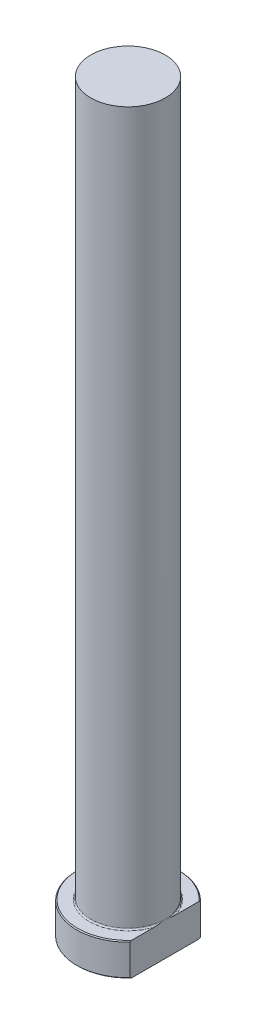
ISO-10303-21;
HEADER;
FILE_DESCRIPTION(('STEP AP214'),'2;1');
FILE_NAME('part.step','',(''),(''),'','','');
FILE_SCHEMA(('AUTOMOTIVE_DESIGN { 1 0 10303 214 1 1 1 1 }'));
ENDSEC;
DATA;
#1=APPLICATION_CONTEXT('core data for automotive mechanical design processes');
#2=APPLICATION_PROTOCOL_DEFINITION('international standard','automotive_design',2000,#1);
#3=PRODUCT_CONTEXT('',#1,'mechanical');
#4=PRODUCT('Part','Part','',(#3));
#5=PRODUCT_RELATED_PRODUCT_CATEGORY('part','',(#4));
#6=PRODUCT_DEFINITION_FORMATION('','',#4);
#7=PRODUCT_DEFINITION_CONTEXT('part definition',#1,'design');
#8=PRODUCT_DEFINITION('design','',#6,#7);
#9=PRODUCT_DEFINITION_SHAPE('','',#8);
#10=(LENGTH_UNIT() NAMED_UNIT(*) SI_UNIT(.MILLI.,.METRE.));
#11=(NAMED_UNIT(*) PLANE_ANGLE_UNIT() SI_UNIT($,.RADIAN.));
#12=(NAMED_UNIT(*) SI_UNIT($,.STERADIAN.) SOLID_ANGLE_UNIT());
#13=UNCERTAINTY_MEASURE_WITH_UNIT(LENGTH_MEASURE(1.E-05),#10,'distance_accuracy_value','');
#14=(GEOMETRIC_REPRESENTATION_CONTEXT(3) GLOBAL_UNCERTAINTY_ASSIGNED_CONTEXT((#13)) GLOBAL_UNIT_ASSIGNED_CONTEXT((#10,
#11,#12)) REPRESENTATION_CONTEXT('',''));
#15=CARTESIAN_POINT('',(0.,0.,0.));
#16=DIRECTION('',(0.,0.,1.));
#17=DIRECTION('',(1.,0.,0.));
#18=AXIS2_PLACEMENT_3D('',#15,#16,#17);
#19=CARTESIAN_POINT('',(0.,0.,0.));
#20=DIRECTION('',(0.,-1.,0.));
#21=DIRECTION('',(0.,0.,-1.));
#22=AXIS2_PLACEMENT_3D('',#19,#20,#21);
#23=PLANE('',#22);
#24=CARTESIAN_POINT('',(0.,0.,0.));
#25=DIRECTION('',(0.,-1.,0.));
#26=DIRECTION('',(0.,0.,-1.));
#27=AXIS2_PLACEMENT_3D('',#24,#25,#26);
#28=CIRCLE('',#27,10.7999999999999);
#29=CARTESIAN_POINT('',(7.99999999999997,0.,7.25534285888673));
#30=VERTEX_POINT('',#29);
#31=CARTESIAN_POINT('',(7.99999999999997,0.,-7.25534285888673));
#32=VERTEX_POINT('',#31);
#33=EDGE_CURVE('E98',#30,#32,#28,.T.);
#34=ORIENTED_EDGE('',*,*,#33,.T.);
#35=DIRECTION('',(0.,0.,1.));
#36=VECTOR('',#35,1.);
#37=CARTESIAN_POINT('',(7.99999999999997,0.,-7.54983443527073));
#38=LINE('',#37,#36);
#39=EDGE_CURVE('E83',#32,#30,#38,.T.);
#40=ORIENTED_EDGE('',*,*,#39,.T.);
#41=EDGE_LOOP('',(#34,#40));
#42=FACE_BOUND('',#41,.T.);
#43=ADVANCED_FACE('F32',(#42),#23,.T.);
#44=CARTESIAN_POINT('',(0.,259.958771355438,0.));
#45=DIRECTION('',(0.,1.,0.));
#46=DIRECTION('',(0.,0.,1.));
#47=AXIS2_PLACEMENT_3D('',#44,#45,#46);
#48=CYLINDRICAL_SURFACE('',#47,11.);
#49=CARTESIAN_POINT('',(0.,6.80000000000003,0.));
#50=DIRECTION('',(0.,1.,0.));
#51=DIRECTION('',(0.,0.,1.));
#52=AXIS2_PLACEMENT_3D('',#49,#50,#51);
#53=CIRCLE('',#52,11.);
#54=CARTESIAN_POINT('',(7.99999999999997,6.80000000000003,7.54983443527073));
#55=VERTEX_POINT('',#54);
#56=CARTESIAN_POINT('',(7.99999999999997,6.80000000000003,-7.54983443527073));
#57=VERTEX_POINT('',#56);
#58=EDGE_CURVE('E104',#55,#57,#53,.F.);
#59=ORIENTED_EDGE('',*,*,#58,.T.);
#60=DIRECTION('',(0.,-1.,0.));
#61=VECTOR('',#60,1.);
#62=CARTESIAN_POINT('',(7.99999999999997,160.,-7.54983443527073));
#63=LINE('',#62,#61);
#64=CARTESIAN_POINT('',(7.99999999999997,0.200000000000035,-7.54983443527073));
#65=VERTEX_POINT('',#64);
#66=EDGE_CURVE('E183',#57,#65,#63,.T.);
#67=ORIENTED_EDGE('',*,*,#66,.T.);
#68=CARTESIAN_POINT('',(0.,0.200000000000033,0.));
#69=DIRECTION('',(0.,-1.,0.));
#70=DIRECTION('',(0.,0.,-1.));
#71=AXIS2_PLACEMENT_3D('',#68,#69,#70);
#72=CIRCLE('',#71,11.);
#73=CARTESIAN_POINT('',(7.99999999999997,0.200000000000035,7.54983443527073));
#74=VERTEX_POINT('',#73);
#75=EDGE_CURVE('E100',#65,#74,#72,.F.);
#76=ORIENTED_EDGE('',*,*,#75,.T.);
#77=DIRECTION('',(0.,-1.,0.));
#78=VECTOR('',#77,1.);
#79=CARTESIAN_POINT('',(7.99999999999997,160.,7.54983443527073));
#80=LINE('',#79,#78);
#81=EDGE_CURVE('E93',#55,#74,#80,.T.);
#82=ORIENTED_EDGE('',*,*,#81,.F.);
#83=EDGE_LOOP('',(#59,#67,#76,#82));
#84=FACE_BOUND('',#83,.T.);
#85=ADVANCED_FACE('F158',(#84),#48,.T.);
#86=CARTESIAN_POINT('',(-11.,7.,0.));
#87=DIRECTION('',(0.,1.,0.));
#88=DIRECTION('',(0.,0.,1.));
#89=AXIS2_PLACEMENT_3D('',#86,#87,#88);
#90=PLANE('',#89);
#91=CARTESIAN_POINT('',(0.,7.,0.));
#92=DIRECTION('',(0.,1.,0.));
#93=DIRECTION('',(0.,0.,1.));
#94=AXIS2_PLACEMENT_3D('',#91,#92,#93);
#95=CIRCLE('',#94,10.8);
#96=CARTESIAN_POINT('',(7.99999999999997,7.,-7.25534285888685));
#97=VERTEX_POINT('',#96);
#98=CARTESIAN_POINT('',(7.99999999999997,7.,7.25534285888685));
#99=VERTEX_POINT('',#98);
#100=EDGE_CURVE('E178',#97,#99,#95,.T.);
#101=ORIENTED_EDGE('',*,*,#100,.T.);
#102=DIRECTION('',(0.,0.,-1.));
#103=VECTOR('',#102,1.);
#104=CARTESIAN_POINT('',(7.99999999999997,7.,0.));
#105=LINE('',#104,#103);
#106=CARTESIAN_POINT('',(7.99999999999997,6.99999999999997,2.21133443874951));
#107=VERTEX_POINT('',#106);
#108=EDGE_CURVE('E57',#99,#107,#105,.T.);
#109=ORIENTED_EDGE('',*,*,#108,.T.);
#110=CARTESIAN_POINT('',(0.,7.,0.));
#111=DIRECTION('',(0.,1.,0.));
#112=DIRECTION('',(0.,0.,1.));
#113=AXIS2_PLACEMENT_3D('',#110,#111,#112);
#114=CIRCLE('',#113,8.29999999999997);
#115=CARTESIAN_POINT('',(7.99999999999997,6.99999999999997,-2.21133443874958));
#116=VERTEX_POINT('',#115);
#117=EDGE_CURVE('E107',#107,#116,#114,.F.);
#118=ORIENTED_EDGE('',*,*,#117,.T.);
#119=EDGE_CURVE('E136',#116,#97,#105,.T.);
#120=ORIENTED_EDGE('',*,*,#119,.T.);
#121=EDGE_LOOP('',(#101,#109,#118,#120));
#122=FACE_BOUND('',#121,.T.);
#123=ADVANCED_FACE('F147',(#122),#90,.T.);
#124=CARTESIAN_POINT('',(0.,7.00000000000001,0.));
#125=DIRECTION('',(0.,-1.,0.));
#126=DIRECTION('',(0.,0.,-1.));
#127=AXIS2_PLACEMENT_3D('',#124,#125,#126);
#128=CONICAL_SURFACE('',#127,10.8,0.785398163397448);
#129=ORIENTED_EDGE('',*,*,#58,.F.);
#130=CARTESIAN_POINT('',(7.99999999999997,-0.636730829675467,16.6106304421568));
#131=CARTESIAN_POINT('',(7.99999999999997,-0.41861176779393,16.3685283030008));
#132=CARTESIAN_POINT('',(7.99999999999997,-0.200984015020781,16.125984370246));
#133=CARTESIAN_POINT('',(7.99999999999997,0.233148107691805,15.6398927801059));
#134=CARTESIAN_POINT('',(7.99999999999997,0.449652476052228,15.3963451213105));
#135=CARTESIAN_POINT('',(7.99999999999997,1.0973998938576,14.6638687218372));
#136=CARTESIAN_POINT('',(7.99999999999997,1.52674426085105,14.1732538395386));
#137=CARTESIAN_POINT('',(7.99999999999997,2.16792810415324,13.4304656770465));
#138=CARTESIAN_POINT('',(7.99999999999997,2.38226067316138,13.1804430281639));
#139=CARTESIAN_POINT('',(7.99999999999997,2.80892954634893,12.6787083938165));
#140=CARTESIAN_POINT('',(7.99999999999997,3.0212658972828,12.4269964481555));
#141=CARTESIAN_POINT('',(7.99999999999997,3.44357020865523,11.9216744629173));
#142=CARTESIAN_POINT('',(7.99999999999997,3.65353861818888,11.6680647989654));
#143=CARTESIAN_POINT('',(7.99999999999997,4.07074862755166,11.1585723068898));
#144=CARTESIAN_POINT('',(7.99999999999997,4.27798998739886,10.9026892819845));
#145=CARTESIAN_POINT('',(7.99999999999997,4.66965190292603,10.4127607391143));
#146=CARTESIAN_POINT('',(7.99999999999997,4.85436868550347,10.1789522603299));
#147=CARTESIAN_POINT('',(7.99999999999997,5.22063517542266,9.70886883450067));
#148=CARTESIAN_POINT('',(7.99999999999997,5.40218492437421,9.47259391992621));
#149=CARTESIAN_POINT('',(7.99999999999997,5.76149237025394,8.99721569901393));
#150=CARTESIAN_POINT('',(7.99999999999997,5.93925050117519,8.75811272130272));
#151=CARTESIAN_POINT('',(7.99999999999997,6.29022306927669,8.27660199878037));
#152=CARTESIAN_POINT('',(7.99999999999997,6.4634376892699,8.03419438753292));
#153=CARTESIAN_POINT('',(7.99999999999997,6.80398487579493,7.54604999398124));
#154=CARTESIAN_POINT('',(7.99999999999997,6.97132935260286,7.30032154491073));
#155=CARTESIAN_POINT('',(7.99999999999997,7.29928849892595,6.80437777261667));
#156=CARTESIAN_POINT('',(7.99999999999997,7.45990280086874,6.55416220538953));
#157=CARTESIAN_POINT('',(7.99999999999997,7.77264940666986,6.04873149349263));
#158=CARTESIAN_POINT('',(7.99999999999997,7.92478824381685,5.79352041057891));
#159=CARTESIAN_POINT('',(7.99999999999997,8.21859570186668,5.27715744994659));
#160=CARTESIAN_POINT('',(7.99999999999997,8.36026610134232,5.01600659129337));
#161=CARTESIAN_POINT('',(7.99999999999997,8.62213596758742,4.5031924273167));
#162=CARTESIAN_POINT('',(7.99999999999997,8.7431198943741,4.25193242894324));
#163=CARTESIAN_POINT('',(7.99999999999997,8.97065709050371,3.74287674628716));
#164=CARTESIAN_POINT('',(7.99999999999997,9.07720941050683,3.48508063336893));
#165=CARTESIAN_POINT('',(7.99999999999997,9.27220860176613,2.96337495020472));
#166=CARTESIAN_POINT('',(7.99999999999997,9.36069936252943,2.69948197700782));
#167=CARTESIAN_POINT('',(7.99999999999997,9.51604316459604,2.16542713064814));
#168=CARTESIAN_POINT('',(7.99999999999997,9.58290677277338,1.89526838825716));
#169=CARTESIAN_POINT('',(7.99999999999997,9.68291221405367,1.39216000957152));
#170=CARTESIAN_POINT('',(7.99999999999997,9.71967474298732,1.15993430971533));
#171=CARTESIAN_POINT('',(7.99999999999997,9.77336730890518,0.693196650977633));
#172=CARTESIAN_POINT('',(7.99999999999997,9.79030037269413,0.458685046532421));
#173=CARTESIAN_POINT('',(7.99999999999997,9.80342851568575,-0.0106727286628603));
#174=CARTESIAN_POINT('',(7.99999999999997,9.79964609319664,-0.245518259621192));
#175=CARTESIAN_POINT('',(7.99999999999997,9.77160926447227,-0.713989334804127));
#176=CARTESIAN_POINT('',(7.99999999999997,9.74735189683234,-0.947614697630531));
#177=CARTESIAN_POINT('',(7.99999999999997,9.67070830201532,-1.47287443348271));
#178=CARTESIAN_POINT('',(7.99999999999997,9.61261890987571,-1.76367634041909));
#179=CARTESIAN_POINT('',(7.99999999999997,9.46982192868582,-2.33873282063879));
#180=CARTESIAN_POINT('',(7.99999999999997,9.38509750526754,-2.62298313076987));
#181=CARTESIAN_POINT('',(7.99999999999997,9.2413431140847,-3.04436856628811));
#182=CARTESIAN_POINT('',(7.99999999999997,9.19048552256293,-3.18437323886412));
#183=CARTESIAN_POINT('',(7.99999999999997,9.08381674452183,-3.46241560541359));
#184=CARTESIAN_POINT('',(7.99999999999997,9.02800782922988,-3.60045416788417));
#185=CARTESIAN_POINT('',(7.99999999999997,8.91195481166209,-3.87463242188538));
#186=CARTESIAN_POINT('',(7.99999999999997,8.85171106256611,-4.01077226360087));
#187=CARTESIAN_POINT('',(7.99999999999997,8.72725899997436,-4.28124317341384));
#188=CARTESIAN_POINT('',(7.99999999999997,8.66305017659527,-4.41557400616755));
#189=CARTESIAN_POINT('',(7.99999999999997,8.48984738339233,-4.76597692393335));
#190=CARTESIAN_POINT('',(7.99999999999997,8.37796178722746,-4.98062176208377));
#191=CARTESIAN_POINT('',(7.99999999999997,8.14649205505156,-5.40573762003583));
#192=CARTESIAN_POINT('',(7.99999999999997,8.02690659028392,-5.61620791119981));
#193=CARTESIAN_POINT('',(7.99999999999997,7.7812870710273,-6.03349586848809));
#194=CARTESIAN_POINT('',(7.99999999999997,7.65524949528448,-6.24031145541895));
#195=CARTESIAN_POINT('',(7.99999999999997,7.39783636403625,-6.65060320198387));
#196=CARTESIAN_POINT('',(7.99999999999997,7.26646042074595,-6.85407911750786));
#197=CARTESIAN_POINT('',(7.99999999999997,6.99890352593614,-7.2585639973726));
#198=CARTESIAN_POINT('',(7.99999999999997,6.86271149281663,-7.45956561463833));
#199=CARTESIAN_POINT('',(7.99999999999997,6.58651908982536,-7.85893907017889));
#200=CARTESIAN_POINT('',(7.99999999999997,6.44651858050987,-8.05731081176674));
#201=CARTESIAN_POINT('',(7.99999999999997,6.02178241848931,-8.64881247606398));
#202=CARTESIAN_POINT('',(7.99999999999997,5.732214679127,-9.03847436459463));
#203=CARTESIAN_POINT('',(7.99999999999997,5.14234581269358,-9.81218500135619));
#204=CARTESIAN_POINT('',(7.99999999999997,4.84200393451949,-10.1962024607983));
#205=CARTESIAN_POINT('',(7.99999999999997,4.23404813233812,-10.9584616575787));
#206=CARTESIAN_POINT('',(7.99999999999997,3.92643376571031,-11.3367030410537));
#207=CARTESIAN_POINT('',(7.99999999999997,3.30600745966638,-12.0880358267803));
#208=CARTESIAN_POINT('',(7.99999999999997,2.99320302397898,-12.4611334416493));
#209=CARTESIAN_POINT('',(7.99999999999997,2.36317801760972,-13.2035599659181));
#210=CARTESIAN_POINT('',(7.99999999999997,2.04595754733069,-13.5728889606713));
#211=CARTESIAN_POINT('',(7.99999999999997,1.33644011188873,-14.3909378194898));
#212=CARTESIAN_POINT('',(7.99999999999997,0.943258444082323,-14.8388897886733));
#213=CARTESIAN_POINT('',(7.99999999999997,0.351483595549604,-15.5068127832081));
#214=CARTESIAN_POINT('',(7.99999999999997,0.15444901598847,-15.7281687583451));
#215=CARTESIAN_POINT('',(7.99999999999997,-0.240498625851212,-16.1700151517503));
#216=CARTESIAN_POINT('',(7.99999999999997,-0.43841150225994,-16.3905057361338));
#217=CARTESIAN_POINT('',(7.99999999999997,-0.63673082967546,-16.6106304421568));
#218=B_SPLINE_CURVE_WITH_KNOTS('',3,(#130,#131,#132,#133,#134,#135,#136,#137,#138,#139,#140,
#141,#142,#143,#144,#145,#146,#147,#148,#149,#150,#151,#152,#153,#154,#155,#156,#157,#158,#159,
#160,#161,#162,#163,#164,#165,#166,#167,#168,#169,#170,#171,#172,#173,#174,#175,#176,#177,#178,
#179,#180,#181,#182,#183,#184,#185,#186,#187,#188,#189,#190,#191,#192,#193,#194,#195,#196,#197,
#198,#199,#200,#201,#202,#203,#204,#205,#206,#207,#208,#209,#210,#211,#212,#213,#214,#215,#216,
#217),.UNSPECIFIED.,.F.,.F.,(4,2,2,2,2,2,2,2,2,2,2,2,2,2,2,2,2,2,2,2,2,2,2,2,2,2,2,2,2,2,2,2,2,
2,2,2,2,2,2,2,2,2,2,4),(0.,0.977598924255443,1.9551992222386,3.91099512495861,4.89893858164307,
5.8868588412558,6.87458847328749,7.86240445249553,8.7562946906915,9.65017317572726,
10.5439487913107,11.4376883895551,12.3294952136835,13.221350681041,14.1125088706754,
15.0035153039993,15.8397621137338,16.6760639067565,17.51030863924,18.3441451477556,
19.0487229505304,19.7531931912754,20.4568984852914,21.1607055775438,22.0488428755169,
22.9375426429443,23.3843335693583,23.830920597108,24.2774720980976,24.7240811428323,
25.4500411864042,26.1761268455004,26.9026130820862,27.6291521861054,28.357488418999,
29.0858513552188,30.5420520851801,32.0045059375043,33.4670490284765,34.9276355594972,
36.3881889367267,38.176245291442,39.0652821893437,39.9541391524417),.UNSPECIFIED.);
#219=EDGE_CURVE('E135',#55,#99,#218,.T.);
#220=ORIENTED_EDGE('',*,*,#219,.T.);
#221=ORIENTED_EDGE('',*,*,#100,.F.);
#222=EDGE_CURVE('E127',#97,#57,#218,.T.);
#223=ORIENTED_EDGE('',*,*,#222,.T.);
#224=EDGE_LOOP('',(#129,#220,#221,#223));
#225=FACE_BOUND('',#224,.T.);
#226=ADVANCED_FACE('F143',(#225),#128,.T.);
#227=CARTESIAN_POINT('',(0.,0.200000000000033,0.));
#228=DIRECTION('',(0.,1.,0.));
#229=DIRECTION('',(0.,0.,1.));
#230=AXIS2_PLACEMENT_3D('',#227,#228,#229);
#231=CONICAL_SURFACE('',#230,11.,0.785398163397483);
#232=ORIENTED_EDGE('',*,*,#75,.F.);
#233=CARTESIAN_POINT('',(7.99999999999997,7.63673082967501,-16.6106304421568));
#234=CARTESIAN_POINT('',(7.99999999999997,7.41861176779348,-16.3685283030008));
#235=CARTESIAN_POINT('',(7.99999999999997,7.20098401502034,-16.125984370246));
#236=CARTESIAN_POINT('',(7.99999999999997,6.76685189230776,-15.6398927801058));
#237=CARTESIAN_POINT('',(7.99999999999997,6.55034752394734,-15.3963451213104));
#238=CARTESIAN_POINT('',(7.99999999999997,5.90260010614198,-14.6638687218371));
#239=CARTESIAN_POINT('',(7.99999999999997,5.47325573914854,-14.1732538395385));
#240=CARTESIAN_POINT('',(7.99999999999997,4.83207189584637,-13.4304656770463));
#241=CARTESIAN_POINT('',(7.99999999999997,4.61773932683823,-13.1804430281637));
#242=CARTESIAN_POINT('',(7.99999999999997,4.19107045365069,-12.6787083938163));
#243=CARTESIAN_POINT('',(7.99999999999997,3.97873410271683,-12.4269964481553));
#244=CARTESIAN_POINT('',(7.99999999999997,3.55642979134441,-11.9216744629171));
#245=CARTESIAN_POINT('',(7.99999999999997,3.34646138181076,-11.6680647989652));
#246=CARTESIAN_POINT('',(7.99999999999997,2.92925137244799,-11.1585723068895));
#247=CARTESIAN_POINT('',(7.99999999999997,2.72201001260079,-10.9026892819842));
#248=CARTESIAN_POINT('',(7.99999999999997,2.33034809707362,-10.412760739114));
#249=CARTESIAN_POINT('',(7.99999999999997,2.14563131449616,-10.1789522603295));
#250=CARTESIAN_POINT('',(7.99999999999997,1.77936482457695,-9.70886883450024));
#251=CARTESIAN_POINT('',(7.99999999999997,1.5978150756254,-9.47259391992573));
#252=CARTESIAN_POINT('',(7.99999999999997,1.23850762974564,-8.99721569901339));
#253=CARTESIAN_POINT('',(7.99999999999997,1.06074949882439,-8.75811272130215));
#254=CARTESIAN_POINT('',(7.99999999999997,0.709776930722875,-8.27660199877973));
#255=CARTESIAN_POINT('',(7.99999999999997,0.53656231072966,-8.03419438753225));
#256=CARTESIAN_POINT('',(7.99999999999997,0.196015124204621,-7.5460499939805));
#257=CARTESIAN_POINT('',(7.99999999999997,0.0286706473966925,-7.30032154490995));
#258=CARTESIAN_POINT('',(7.99999999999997,-0.299288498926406,-6.80437777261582));
#259=CARTESIAN_POINT('',(7.99999999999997,-0.459902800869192,-6.55416220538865));
#260=CARTESIAN_POINT('',(7.99999999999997,-0.772649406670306,-6.04873149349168));
#261=CARTESIAN_POINT('',(7.99999999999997,-0.924788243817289,-5.79352041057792));
#262=CARTESIAN_POINT('',(7.99999999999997,-1.21859570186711,-5.27715744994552));
#263=CARTESIAN_POINT('',(7.99999999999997,-1.36026610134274,-5.01600659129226));
#264=CARTESIAN_POINT('',(7.99999999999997,-1.6221359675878,-4.50319242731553));
#265=CARTESIAN_POINT('',(7.99999999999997,-1.74311989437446,-4.25193242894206));
#266=CARTESIAN_POINT('',(7.99999999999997,-1.97065709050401,-3.74287674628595));
#267=CARTESIAN_POINT('',(7.99999999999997,-2.0772094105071,-3.4850806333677));
#268=CARTESIAN_POINT('',(7.99999999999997,-2.27220860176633,-2.96337495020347));
#269=CARTESIAN_POINT('',(7.99999999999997,-2.36069936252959,-2.69948197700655));
#270=CARTESIAN_POINT('',(7.99999999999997,-2.51604316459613,-2.16542713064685));
#271=CARTESIAN_POINT('',(7.99999999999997,-2.58290677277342,-1.89526838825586));
#272=CARTESIAN_POINT('',(7.99999999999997,-2.68291221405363,-1.39216000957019));
#273=CARTESIAN_POINT('',(7.99999999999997,-2.71967474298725,-1.15993430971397));
#274=CARTESIAN_POINT('',(7.99999999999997,-2.77336730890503,-0.693196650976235));
#275=CARTESIAN_POINT('',(7.99999999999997,-2.79030037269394,-0.458685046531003));
#276=CARTESIAN_POINT('',(7.99999999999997,-2.80342851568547,0.0106727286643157));
#277=CARTESIAN_POINT('',(7.99999999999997,-2.79964609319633,0.245518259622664));
#278=CARTESIAN_POINT('',(7.99999999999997,-2.77160926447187,0.713989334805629));
#279=CARTESIAN_POINT('',(7.99999999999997,-2.74735189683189,0.947614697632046));
#280=CARTESIAN_POINT('',(7.99999999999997,-2.67070830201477,1.47287443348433));
#281=CARTESIAN_POINT('',(7.99999999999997,-2.61261890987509,1.76367634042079));
#282=CARTESIAN_POINT('',(7.99999999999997,-2.46982192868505,2.33873282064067));
#283=CARTESIAN_POINT('',(7.99999999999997,-2.38509750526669,2.62298313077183));
#284=CARTESIAN_POINT('',(7.99999999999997,-2.24134311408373,3.04436856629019));
#285=CARTESIAN_POINT('',(7.99999999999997,-2.19048552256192,3.18437323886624));
#286=CARTESIAN_POINT('',(7.99999999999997,-2.08381674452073,3.46241560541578));
#287=CARTESIAN_POINT('',(7.99999999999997,-2.02800782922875,3.6004541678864));
#288=CARTESIAN_POINT('',(7.99999999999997,-1.91195481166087,3.87463242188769));
#289=CARTESIAN_POINT('',(7.99999999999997,-1.85171106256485,4.01077226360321));
#290=CARTESIAN_POINT('',(7.99999999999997,-1.72725899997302,4.28124317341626));
#291=CARTESIAN_POINT('',(7.99999999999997,-1.66305017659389,4.41557400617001));
#292=CARTESIAN_POINT('',(7.99999999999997,-1.48984738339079,4.76597692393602));
#293=CARTESIAN_POINT('',(7.99999999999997,-1.37796178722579,4.9806217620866));
#294=CARTESIAN_POINT('',(7.99999999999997,-1.14649205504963,5.405737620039));
#295=CARTESIAN_POINT('',(7.99999999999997,-1.02690659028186,5.61620791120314));
#296=CARTESIAN_POINT('',(7.99999999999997,-0.781287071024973,6.03349586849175));
#297=CARTESIAN_POINT('',(7.99999999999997,-0.65524949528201,6.24031145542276));
#298=CARTESIAN_POINT('',(7.99999999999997,-0.397836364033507,6.65060320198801));
#299=CARTESIAN_POINT('',(7.99999999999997,-0.266460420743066,6.85407911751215));
#300=CARTESIAN_POINT('',(7.99999999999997,0.00109647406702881,7.2585639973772));
#301=CARTESIAN_POINT('',(7.99999999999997,0.137288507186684,7.45956561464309));
#302=CARTESIAN_POINT('',(7.99999999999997,0.413480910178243,7.85893907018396));
#303=CARTESIAN_POINT('',(7.99999999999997,0.553481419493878,8.05731081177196));
#304=CARTESIAN_POINT('',(7.99999999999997,0.978217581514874,8.64881247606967));
#305=CARTESIAN_POINT('',(7.99999999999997,1.26778532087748,9.03847436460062));
#306=CARTESIAN_POINT('',(7.99999999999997,1.85765418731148,9.81218500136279));
#307=CARTESIAN_POINT('',(7.99999999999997,2.15799606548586,10.1962024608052));
#308=CARTESIAN_POINT('',(7.99999999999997,2.76595186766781,10.9584616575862));
#309=CARTESIAN_POINT('',(7.99999999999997,3.07356623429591,11.3367030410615));
#310=CARTESIAN_POINT('',(7.99999999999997,3.69399254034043,12.0880358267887));
#311=CARTESIAN_POINT('',(7.99999999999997,4.00679697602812,12.461133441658));
#312=CARTESIAN_POINT('',(7.99999999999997,4.63682198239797,13.2035599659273));
#313=CARTESIAN_POINT('',(7.99999999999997,4.95404245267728,13.5728889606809));
#314=CARTESIAN_POINT('',(7.99999999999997,5.66355988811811,14.390937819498));
#315=CARTESIAN_POINT('',(7.99999999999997,6.05674155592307,14.8388897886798));
#316=CARTESIAN_POINT('',(7.99999999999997,6.6485164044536,15.5068127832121));
#317=CARTESIAN_POINT('',(7.99999999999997,6.845550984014,15.7281687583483));
#318=CARTESIAN_POINT('',(7.99999999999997,7.24049862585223,16.1700151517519));
#319=CARTESIAN_POINT('',(7.99999999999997,7.43841150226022,16.3905057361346));
#320=CARTESIAN_POINT('',(7.99999999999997,7.63673082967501,16.6106304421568));
#321=B_SPLINE_CURVE_WITH_KNOTS('',3,(#233,#234,#235,#236,#237,#238,#239,#240,#241,#242,#243,
#244,#245,#246,#247,#248,#249,#250,#251,#252,#253,#254,#255,#256,#257,#258,#259,#260,#261,#262,
#263,#264,#265,#266,#267,#268,#269,#270,#271,#272,#273,#274,#275,#276,#277,#278,#279,#280,#281,
#282,#283,#284,#285,#286,#287,#288,#289,#290,#291,#292,#293,#294,#295,#296,#297,#298,#299,#300,
#301,#302,#303,#304,#305,#306,#307,#308,#309,#310,#311,#312,#313,#314,#315,#316,#317,#318,#319,
#320),.UNSPECIFIED.,.F.,.F.,(4,2,2,2,2,2,2,2,2,2,2,2,2,2,2,2,2,2,2,2,2,2,2,2,2,2,2,2,2,2,2,2,2,
2,2,2,2,2,2,2,2,2,2,4),(0.,0.977598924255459,1.95519922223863,3.91099512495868,4.89893858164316,
5.88685884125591,6.87458847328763,7.8624044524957,8.75629469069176,9.65017317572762,
10.5439487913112,11.4376883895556,12.3294952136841,13.2213506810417,14.1125088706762,
15.0035153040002,15.8397621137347,16.6760639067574,17.510308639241,18.3441451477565,
19.0487229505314,19.7531931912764,20.4568984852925,21.1607055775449,22.0488428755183,
22.937542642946,23.3843335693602,23.83092059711,24.2774720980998,24.7240811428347,
25.4500411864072,26.176126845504,26.9026130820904,27.6291521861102,28.3574884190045,
29.0858513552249,30.5420520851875,32.0045059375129,33.4670490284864,34.9276355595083,
36.388188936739,38.1762452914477,39.0652821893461,39.9541391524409),.UNSPECIFIED.);
#322=EDGE_CURVE('E86',#65,#32,#321,.T.);
#323=ORIENTED_EDGE('',*,*,#322,.T.);
#324=ORIENTED_EDGE('',*,*,#33,.F.);
#325=EDGE_CURVE('E89',#30,#74,#321,.T.);
#326=ORIENTED_EDGE('',*,*,#325,.T.);
#327=EDGE_LOOP('',(#232,#323,#324,#326));
#328=FACE_BOUND('',#327,.T.);
#329=ADVANCED_FACE('F97',(#328),#231,.T.);
#330=CARTESIAN_POINT('',(0.,7.29999999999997,0.));
#331=DIRECTION('',(0.,1.,0.));
#332=DIRECTION('',(0.,0.,1.));
#333=AXIS2_PLACEMENT_3D('',#330,#331,#332);
#334=TOROIDAL_SURFACE('',#333,8.29999999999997,0.3);
#335=CARTESIAN_POINT('',(7.99999999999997,7.29999999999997,0.));
#336=CARTESIAN_POINT('',(7.99999999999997,7.30000062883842,1.41343368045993E-10));
#337=CARTESIAN_POINT('',(7.99999999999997,7.30000125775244,-3.45355322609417E-07));
#338=CARTESIAN_POINT('',(7.99999999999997,7.30000241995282,-1.23398463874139E-06));
#339=CARTESIAN_POINT('',(7.99999999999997,7.30000291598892,-1.80141989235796E-06));
#340=CARTESIAN_POINT('',(7.99999999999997,7.30000399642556,-3.18390842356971E-06));
#341=CARTESIAN_POINT('',(7.99999999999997,7.30000456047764,-4.02115832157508E-06));
#342=CARTESIAN_POINT('',(7.99999999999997,7.30000552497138,-5.71072460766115E-06));
#343=CARTESIAN_POINT('',(7.99999999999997,7.30000593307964,-6.55926444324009E-06));
#344=CARTESIAN_POINT('',(7.99999999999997,7.30000755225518,-1.000964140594E-05));
#345=CARTESIAN_POINT('',(7.99999999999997,7.30000869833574,-1.26477244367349E-05));
#346=CARTESIAN_POINT('',(7.99999999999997,7.30001047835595,-1.77422280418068E-05));
#347=CARTESIAN_POINT('',(7.99999999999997,7.30001115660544,-2.01836505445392E-05));
#348=CARTESIAN_POINT('',(7.99999999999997,7.30001417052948,-3.09435594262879E-05));
#349=CARTESIAN_POINT('',(7.99999999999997,7.30001656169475,-3.92473415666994E-05));
#350=CARTESIAN_POINT('',(7.99999999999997,7.30001991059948,-5.46311733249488E-05));
#351=CARTESIAN_POINT('',(7.99999999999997,7.30002104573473,-6.16717033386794E-05));
#352=CARTESIAN_POINT('',(7.99999999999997,7.30002955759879,-0.000115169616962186));
#353=CARTESIAN_POINT('',(7.99999999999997,7.30003630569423,-0.000161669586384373));
#354=CARTESIAN_POINT('',(7.99999999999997,7.30006581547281,-0.00034712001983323));
#355=CARTESIAN_POINT('',(7.99999999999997,7.30009364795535,-0.000485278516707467));
#356=CARTESIAN_POINT('',(7.99999999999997,7.30020325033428,-0.00103711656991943));
#357=CARTESIAN_POINT('',(7.99999999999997,7.30028197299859,-0.00145117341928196));
#358=CARTESIAN_POINT('',(7.99999999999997,7.30059973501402,-0.00311182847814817));
#359=CARTESIAN_POINT('',(7.99999999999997,7.30084275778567,-0.00435790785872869));
#360=CARTESIAN_POINT('',(7.99999999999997,7.30186073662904,-0.00958966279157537));
#361=CARTESIAN_POINT('',(7.99999999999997,7.30263061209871,-0.0135760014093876));
#362=CARTESIAN_POINT('',(7.99999999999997,7.30870312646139,-0.0450030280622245));
#363=CARTESIAN_POINT('',(7.99999999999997,7.31402334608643,-0.0724414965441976));
#364=CARTESIAN_POINT('',(7.99999999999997,7.32442239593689,-0.126197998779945));
#365=CARTESIAN_POINT('',(7.99999999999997,7.32950218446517,-0.152515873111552));
#366=CARTESIAN_POINT('',(7.99999999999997,7.34609783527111,-0.23868034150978));
#367=CARTESIAN_POINT('',(7.99999999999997,7.35757011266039,-0.29853557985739));
#368=CARTESIAN_POINT('',(7.99999999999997,7.37688511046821,-0.400403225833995));
#369=CARTESIAN_POINT('',(7.99999999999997,7.38478827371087,-0.442404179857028));
#370=CARTESIAN_POINT('',(7.99999999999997,7.40022249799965,-0.525284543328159));
#371=CARTESIAN_POINT('',(7.99999999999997,7.40775782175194,-0.566163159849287));
#372=CARTESIAN_POINT('',(7.99999999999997,7.4322438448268,-0.700743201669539));
#373=CARTESIAN_POINT('',(7.99999999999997,7.44879297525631,-0.794518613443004));
#374=CARTESIAN_POINT('',(7.99999999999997,7.48053424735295,-0.983225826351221));
#375=CARTESIAN_POINT('',(7.99999999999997,7.49571186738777,-1.07816009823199));
#376=CARTESIAN_POINT('',(7.99999999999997,7.52532008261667,-1.27781321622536));
#377=CARTESIAN_POINT('',(7.99999999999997,7.53952614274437,-1.38256589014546));
#378=CARTESIAN_POINT('',(7.99999999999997,7.564310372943,-1.59223320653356));
#379=CARTESIAN_POINT('',(7.99999999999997,7.57489817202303,-1.6971466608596));
#380=CARTESIAN_POINT('',(7.99999999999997,7.58780012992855,-1.86417161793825));
#381=CARTESIAN_POINT('',(7.99999999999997,7.59172630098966,-1.92615747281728));
#382=CARTESIAN_POINT('',(7.99999999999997,7.59748111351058,-2.05022364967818));
#383=CARTESIAN_POINT('',(7.99999999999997,7.59931001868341,-2.11230395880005));
#384=CARTESIAN_POINT('',(7.99999999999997,7.60036180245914,-2.23528941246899));
#385=CARTESIAN_POINT('',(7.99999999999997,7.59963462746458,-2.29619395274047));
#386=CARTESIAN_POINT('',(7.99999999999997,7.59500883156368,-2.41785147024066));
#387=CARTESIAN_POINT('',(7.99999999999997,7.59111224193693,-2.47860451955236));
#388=CARTESIAN_POINT('',(7.99999999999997,7.57906933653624,-2.60042626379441));
#389=CARTESIAN_POINT('',(7.99999999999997,7.570876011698,-2.66149089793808));
#390=CARTESIAN_POINT('',(7.99999999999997,7.55390997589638,-2.7523359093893));
#391=CARTESIAN_POINT('',(7.99999999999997,7.54745990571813,-2.78254437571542));
#392=CARTESIAN_POINT('',(7.99999999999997,7.5325641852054,-2.84244543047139));
#393=CARTESIAN_POINT('',(7.99999999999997,7.52412026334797,-2.87213844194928));
#394=CARTESIAN_POINT('',(7.99999999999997,7.50454333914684,-2.93081083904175));
#395=CARTESIAN_POINT('',(7.99999999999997,7.4933995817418,-2.95978684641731));
#396=CARTESIAN_POINT('',(7.99999999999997,7.47379430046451,-3.00191342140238));
#397=CARTESIAN_POINT('',(7.99999999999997,7.46677809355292,-3.01573193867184));
#398=CARTESIAN_POINT('',(7.99999999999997,7.45153430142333,-3.04267574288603));
#399=CARTESIAN_POINT('',(7.99999999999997,7.44330842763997,-3.05580197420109));
#400=CARTESIAN_POINT('',(7.99999999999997,7.42520334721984,-3.0811225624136));
#401=CARTESIAN_POINT('',(7.99999999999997,7.41530529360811,-3.09330368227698));
#402=CARTESIAN_POINT('',(7.99999999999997,7.39348961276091,-3.11567039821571));
#403=CARTESIAN_POINT('',(7.99999999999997,7.38158911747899,-3.12587146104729));
#404=CARTESIAN_POINT('',(7.99999999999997,7.3626809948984,-3.13802739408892));
#405=CARTESIAN_POINT('',(7.99999999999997,7.35660667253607,-3.14142291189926));
#406=CARTESIAN_POINT('',(7.99999999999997,7.34401523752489,-3.14727797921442));
#407=CARTESIAN_POINT('',(7.99999999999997,7.33749832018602,-3.14973793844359));
#408=CARTESIAN_POINT('',(7.99999999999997,7.32406766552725,-3.15352036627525));
#409=CARTESIAN_POINT('',(7.99999999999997,7.31715078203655,-3.15483196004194));
#410=CARTESIAN_POINT('',(7.99999999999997,7.30319454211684,-3.15612126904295));
#411=CARTESIAN_POINT('',(7.99999999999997,7.29615528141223,-3.15609998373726));
#412=CARTESIAN_POINT('',(7.99999999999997,7.28287791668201,-3.15479583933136));
#413=CARTESIAN_POINT('',(7.99999999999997,7.27662738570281,-3.15363338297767));
#414=CARTESIAN_POINT('',(7.99999999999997,7.26438977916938,-3.15033645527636));
#415=CARTESIAN_POINT('',(7.99999999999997,7.25840290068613,-3.14820126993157));
#416=CARTESIAN_POINT('',(7.99999999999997,7.24428488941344,-3.14202752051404));
#417=CARTESIAN_POINT('',(7.99999999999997,7.2363403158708,-3.13756526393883));
#418=CARTESIAN_POINT('',(7.99999999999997,7.22124755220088,-3.1274544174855));
#419=CARTESIAN_POINT('',(7.99999999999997,7.21410153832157,-3.12180270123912));
#420=CARTESIAN_POINT('',(7.99999999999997,7.19559955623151,-3.10524942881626));
#421=CARTESIAN_POINT('',(7.99999999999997,7.18498382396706,-3.09352989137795));
#422=CARTESIAN_POINT('',(7.99999999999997,7.16550497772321,-3.068745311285));
#423=CARTESIAN_POINT('',(7.99999999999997,7.15664572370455,-3.05567739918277));
#424=CARTESIAN_POINT('',(7.99999999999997,7.13735489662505,-3.02391619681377));
#425=CARTESIAN_POINT('',(7.99999999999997,7.12749252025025,-3.00488123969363));
#426=CARTESIAN_POINT('',(7.99999999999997,7.10958189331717,-2.96596235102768));
#427=CARTESIAN_POINT('',(7.99999999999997,7.10153733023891,-2.9460767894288));
#428=CARTESIAN_POINT('',(7.99999999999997,7.08679055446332,-2.90559744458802));
#429=CARTESIAN_POINT('',(7.99999999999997,7.08010240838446,-2.88499860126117));
#430=CARTESIAN_POINT('',(7.99999999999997,7.06789000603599,-2.84348873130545));
#431=CARTESIAN_POINT('',(7.99999999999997,7.06236453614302,-2.8225780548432));
#432=CARTESIAN_POINT('',(7.99999999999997,7.04913807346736,-2.76752236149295));
#433=CARTESIAN_POINT('',(7.99999999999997,7.04220598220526,-2.73319311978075));
#434=CARTESIAN_POINT('',(7.99999999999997,7.0302605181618,-2.66419726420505));
#435=CARTESIAN_POINT('',(7.99999999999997,7.02524820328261,-2.62953047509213));
#436=CARTESIAN_POINT('',(7.99999999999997,7.0124950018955,-2.52504816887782));
#437=CARTESIAN_POINT('',(7.99999999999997,7.00708017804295,-2.45494936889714));
#438=CARTESIAN_POINT('',(7.99999999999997,7.000733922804,-2.31725135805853));
#439=CARTESIAN_POINT('',(7.99999999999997,6.99964073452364,-2.24965783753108));
#440=CARTESIAN_POINT('',(7.99999999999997,7.00055672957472,-2.11488194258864));
#441=CARTESIAN_POINT('',(7.99999999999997,7.00254831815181,-2.04769941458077));
#442=CARTESIAN_POINT('',(7.99999999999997,7.00911662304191,-1.91019632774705));
#443=CARTESIAN_POINT('',(7.99999999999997,7.01381425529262,-1.83988191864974));
#444=CARTESIAN_POINT('',(7.99999999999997,7.02534418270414,-1.69947139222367));
#445=CARTESIAN_POINT('',(7.99999999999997,7.0321753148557,-1.62937517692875));
#446=CARTESIAN_POINT('',(7.99999999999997,7.04774659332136,-1.48770318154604));
#447=CARTESIAN_POINT('',(7.99999999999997,7.05652844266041,-1.41613205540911));
#448=CARTESIAN_POINT('',(7.99999999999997,7.0755719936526,-1.2729917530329));
#449=CARTESIAN_POINT('',(7.99999999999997,7.08583764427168,-1.20142310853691));
#450=CARTESIAN_POINT('',(7.99999999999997,7.11167035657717,-1.03117663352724));
#451=CARTESIAN_POINT('',(7.99999999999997,7.12776522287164,-0.932579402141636));
#452=CARTESIAN_POINT('',(7.99999999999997,7.16130143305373,-0.736797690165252));
#453=CARTESIAN_POINT('',(7.99999999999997,7.1787249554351,-0.639610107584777));
#454=CARTESIAN_POINT('',(7.99999999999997,7.21241690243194,-0.456833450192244));
#455=CARTESIAN_POINT('',(7.99999999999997,7.22858010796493,-0.37122483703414));
#456=CARTESIAN_POINT('',(7.99999999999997,7.25353789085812,-0.240583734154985));
#457=CARTESIAN_POINT('',(7.99999999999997,7.26219901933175,-0.195525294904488));
#458=CARTESIAN_POINT('',(7.99999999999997,7.27945035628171,-0.106166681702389));
#459=CARTESIAN_POINT('',(7.99999999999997,7.28803936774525,-0.0618662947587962));
#460=CARTESIAN_POINT('',(7.99999999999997,7.29737150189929,-0.0135646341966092));
#461=CARTESIAN_POINT('',(7.99999999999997,7.29814363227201,-0.0095669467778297));
#462=CARTESIAN_POINT('',(7.99999999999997,7.29916212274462,-0.0043326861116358));
#463=CARTESIAN_POINT('',(7.99999999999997,7.29940341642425,-0.003095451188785));
#464=CARTESIAN_POINT('',(7.99999999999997,7.29971907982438,-0.00144576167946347));
#465=CARTESIAN_POINT('',(7.99999999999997,7.29979739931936,-0.00103382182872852));
#466=CARTESIAN_POINT('',(7.99999999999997,7.29990652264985,-0.000484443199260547));
#467=CARTESIAN_POINT('',(7.99999999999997,7.29993429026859,-0.000346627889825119));
#468=CARTESIAN_POINT('',(7.99999999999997,7.2999637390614,-0.000161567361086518));
#469=CARTESIAN_POINT('',(7.99999999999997,7.29997047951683,-0.000115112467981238));
#470=CARTESIAN_POINT('',(7.99999999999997,7.29997897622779,-6.16610384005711E-05));
#471=CARTESIAN_POINT('',(7.99999999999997,7.29998010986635,-5.46227082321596E-05));
#472=CARTESIAN_POINT('',(7.99999999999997,7.299983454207,-3.92436766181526E-05));
#473=CARTESIAN_POINT('',(7.99999999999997,7.2999858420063,-3.09423877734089E-05));
#474=CARTESIAN_POINT('',(7.99999999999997,7.29998885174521,-2.01851368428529E-05));
#475=CARTESIAN_POINT('',(7.99999999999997,7.29998952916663,-1.7743877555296E-05));
#476=CARTESIAN_POINT('',(7.99999999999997,7.29999130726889,-1.26495938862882E-05));
#477=CARTESIAN_POINT('',(7.99999999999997,7.29999245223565,-1.00115437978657E-05));
#478=CARTESIAN_POINT('',(7.99999999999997,7.29999406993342,-6.56108535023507E-06));
#479=CARTESIAN_POINT('',(7.99999999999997,7.29999447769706,-5.71247448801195E-06));
#480=CARTESIAN_POINT('',(7.99999999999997,7.29999544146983,-4.02270412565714E-06));
#481=CARTESIAN_POINT('',(7.99999999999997,7.2999960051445,-3.18531707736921E-06));
#482=CARTESIAN_POINT('',(7.99999999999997,7.29999708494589,-1.80252014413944E-06));
#483=CARTESIAN_POINT('',(7.99999999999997,7.29999758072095,-1.23492752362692E-06));
#484=CARTESIAN_POINT('',(7.99999999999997,7.29999874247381,-3.45879353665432E-07));
#485=CARTESIAN_POINT('',(7.99999999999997,7.29999937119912,-1.41334918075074E-10));
#486=CARTESIAN_POINT('',(7.99999999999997,7.29999999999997,0.));
#487=B_SPLINE_CURVE_WITH_KNOTS('',3,(#335,#336,#337,#338,#339,#340,#341,#342,#343,#344,#345,
#346,#347,#348,#349,#350,#351,#352,#353,#354,#355,#356,#357,#358,#359,#360,#361,#362,#363,#364,
#365,#366,#367,#368,#369,#370,#371,#372,#373,#374,#375,#376,#377,#378,#379,#380,#381,#382,#383,
#384,#385,#386,#387,#388,#389,#390,#391,#392,#393,#394,#395,#396,#397,#398,#399,#400,#401,#402,
#403,#404,#405,#406,#407,#408,#409,#410,#411,#412,#413,#414,#415,#416,#417,#418,#419,#420,#421,
#422,#423,#424,#425,#426,#427,#428,#429,#430,#431,#432,#433,#434,#435,#436,#437,#438,#439,#440,
#441,#442,#443,#444,#445,#446,#447,#448,#449,#450,#451,#452,#453,#454,#455,#456,#457,#458,#459,
#460,#461,#462,#463,#464,#465,#466,#467,#468,#469,#470,#471,#472,#473,#474,#475,#476,#477,#478,
#479,#480,#481,#482,#483,#484,#485,#486),.UNSPECIFIED.,.T.,.F.,(4,2,2,2,2,2,2,2,2,2,2,2,2,2,2,2,
2,2,2,2,2,2,2,2,2,2,2,2,2,2,2,2,2,2,2,2,2,2,2,2,2,2,2,2,2,2,2,2,2,2,2,2,2,2,2,2,2,2,2,2,2,2,2,2,
2,2,2,2,2,2,2,2,2,2,2,4),(0.,1.9430465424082E-06,4.23378863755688E-06,7.23541659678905E-06,
1.00606572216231E-05,1.86645549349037E-05,2.62590397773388E-05,5.21541728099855E-05,
7.352737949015E-05,0.000214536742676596,0.000637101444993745,0.00190178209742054,
0.00571013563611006,0.0178905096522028,0.101737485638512,0.182148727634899,0.364982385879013,
0.493196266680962,0.617898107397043,0.903563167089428,1.19196538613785,1.50905932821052,
1.82530271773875,2.01160528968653,2.19788443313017,2.38054404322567,2.56308667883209,
2.74766944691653,2.84028504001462,2.93282063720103,3.02573110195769,3.07218090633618,
3.11856561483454,3.1655130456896,3.21207753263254,3.23289308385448,3.25369950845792,
3.27470089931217,3.29568654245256,3.31467256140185,3.33367253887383,3.36085270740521,
3.38810522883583,3.43527567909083,3.48254866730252,3.54671214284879,3.61100462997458,
3.67593313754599,3.74079353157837,3.8457803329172,3.95082490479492,4.16152093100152,
4.36425153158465,4.56583006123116,4.77720385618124,4.98846262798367,5.20476776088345,
5.42165954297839,5.72134671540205,6.01755113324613,6.27891230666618,6.41656286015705,
6.55193629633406,6.56415137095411,6.56793269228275,6.5691909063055,6.56961242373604,
6.56975329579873,6.56977466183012,6.5698005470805,6.56980814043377,6.56981674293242,
6.56981956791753,6.56982256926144,6.56982485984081,6.56982680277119),.UNSPECIFIED.);
#488=CARTESIAN_POINT('',(7.99999999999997,7.29999999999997,0.));
#489=VERTEX_POINT('',#488);
#490=EDGE_CURVE('E11',#116,#489,#487,.T.);
#491=ORIENTED_EDGE('',*,*,#490,.F.);
#492=ORIENTED_EDGE('',*,*,#117,.F.);
#493=CARTESIAN_POINT('',(7.99999999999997,7.29999999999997,0.));
#494=CARTESIAN_POINT('',(7.99999999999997,7.29999937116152,-1.41343611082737E-10));
#495=CARTESIAN_POINT('',(7.99999999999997,7.29999874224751,3.45355322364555E-07));
#496=CARTESIAN_POINT('',(7.99999999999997,7.29999758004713,1.23398463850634E-06));
#497=CARTESIAN_POINT('',(7.99999999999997,7.29999708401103,1.80141989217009E-06));
#498=CARTESIAN_POINT('',(7.99999999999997,7.29999600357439,3.18390842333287E-06));
#499=CARTESIAN_POINT('',(7.99999999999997,7.29999543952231,4.0211583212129E-06));
#500=CARTESIAN_POINT('',(7.99999999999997,7.29999447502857,5.71072460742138E-06));
#501=CARTESIAN_POINT('',(7.99999999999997,7.2999940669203,6.55926444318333E-06));
#502=CARTESIAN_POINT('',(7.99999999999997,7.29999244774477,1.00096414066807E-05));
#503=CARTESIAN_POINT('',(7.99999999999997,7.2999913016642,1.26477244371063E-05));
#504=CARTESIAN_POINT('',(7.99999999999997,7.29998952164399,1.77422280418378E-05));
#505=CARTESIAN_POINT('',(7.99999999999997,7.2999888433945,2.01836505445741E-05));
#506=CARTESIAN_POINT('',(7.99999999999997,7.29998582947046,3.09435594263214E-05));
#507=CARTESIAN_POINT('',(7.99999999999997,7.29998343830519,3.92473415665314E-05));
#508=CARTESIAN_POINT('',(7.99999999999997,7.29998008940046,5.46311733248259E-05));
#509=CARTESIAN_POINT('',(7.99999999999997,7.29997895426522,6.16717033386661E-05));
#510=CARTESIAN_POINT('',(7.99999999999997,7.29997044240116,0.000115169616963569));
#511=CARTESIAN_POINT('',(7.99999999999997,7.29996369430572,0.000161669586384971));
#512=CARTESIAN_POINT('',(7.99999999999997,7.29993418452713,0.000347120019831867));
#513=CARTESIAN_POINT('',(7.99999999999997,7.2999063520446,0.000485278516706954));
#514=CARTESIAN_POINT('',(7.99999999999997,7.29979674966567,0.00103711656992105));
#515=CARTESIAN_POINT('',(7.99999999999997,7.29971802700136,0.00145117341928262));
#516=CARTESIAN_POINT('',(7.99999999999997,7.29940026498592,0.00311182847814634));
#517=CARTESIAN_POINT('',(7.99999999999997,7.29915724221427,0.00435790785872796));
#518=CARTESIAN_POINT('',(7.99999999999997,7.29813926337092,0.00958966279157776));
#519=CARTESIAN_POINT('',(7.99999999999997,7.29736938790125,0.0135760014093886));
#520=CARTESIAN_POINT('',(7.99999999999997,7.29129687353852,0.0450030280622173));
#521=CARTESIAN_POINT('',(7.99999999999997,7.28597665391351,0.0724414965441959));
#522=CARTESIAN_POINT('',(7.99999999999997,7.27557760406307,0.126197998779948));
#523=CARTESIAN_POINT('',(7.99999999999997,7.27049781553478,0.152515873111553));
#524=CARTESIAN_POINT('',(7.99999999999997,7.25390216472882,0.238680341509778));
#525=CARTESIAN_POINT('',(7.99999999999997,7.24242988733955,0.29853557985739));
#526=CARTESIAN_POINT('',(7.99999999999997,7.22311488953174,0.400403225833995));
#527=CARTESIAN_POINT('',(7.99999999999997,7.21521172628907,0.442404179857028));
#528=CARTESIAN_POINT('',(7.99999999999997,7.19977750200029,0.525284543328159));
#529=CARTESIAN_POINT('',(7.99999999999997,7.192242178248,0.566163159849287));
#530=CARTESIAN_POINT('',(7.99999999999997,7.16775615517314,0.700743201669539));
#531=CARTESIAN_POINT('',(7.99999999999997,7.15120702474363,0.794518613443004));
#532=CARTESIAN_POINT('',(7.99999999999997,7.119465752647,0.983225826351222));
#533=CARTESIAN_POINT('',(7.99999999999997,7.10428813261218,1.07816009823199));
#534=CARTESIAN_POINT('',(7.99999999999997,7.07467991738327,1.27781321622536));
#535=CARTESIAN_POINT('',(7.99999999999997,7.06047385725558,1.38256589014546));
#536=CARTESIAN_POINT('',(7.99999999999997,7.03568962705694,1.59223320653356));
#537=CARTESIAN_POINT('',(7.99999999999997,7.02510182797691,1.6971466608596));
#538=CARTESIAN_POINT('',(7.99999999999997,7.0121998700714,1.86417161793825));
#539=CARTESIAN_POINT('',(7.99999999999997,7.00827369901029,1.92615747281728));
#540=CARTESIAN_POINT('',(7.99999999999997,7.00251888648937,2.05022364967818));
#541=CARTESIAN_POINT('',(7.99999999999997,7.00068998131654,2.11230395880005));
#542=CARTESIAN_POINT('',(7.99999999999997,6.99963819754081,2.23528941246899));
#543=CARTESIAN_POINT('',(7.99999999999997,7.00036537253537,2.29619395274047));
#544=CARTESIAN_POINT('',(7.99999999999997,7.00499116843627,2.41785147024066));
#545=CARTESIAN_POINT('',(7.99999999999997,7.00888775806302,2.47860451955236));
#546=CARTESIAN_POINT('',(7.99999999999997,7.0209306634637,2.60042626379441));
#547=CARTESIAN_POINT('',(7.99999999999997,7.02912398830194,2.66149089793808));
#548=CARTESIAN_POINT('',(7.99999999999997,7.04609002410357,2.7523359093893));
#549=CARTESIAN_POINT('',(7.99999999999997,7.05254009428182,2.78254437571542));
#550=CARTESIAN_POINT('',(7.99999999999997,7.06743581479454,2.84244543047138));
#551=CARTESIAN_POINT('',(7.99999999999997,7.07587973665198,2.87213844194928));
#552=CARTESIAN_POINT('',(7.99999999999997,7.09545666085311,2.93081083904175));
#553=CARTESIAN_POINT('',(7.99999999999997,7.10660041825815,2.95978684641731));
#554=CARTESIAN_POINT('',(7.99999999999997,7.12620569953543,3.00191342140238));
#555=CARTESIAN_POINT('',(7.99999999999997,7.13322190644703,3.01573193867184));
#556=CARTESIAN_POINT('',(7.99999999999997,7.14846569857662,3.04267574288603));
#557=CARTESIAN_POINT('',(7.99999999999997,7.15669157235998,3.05580197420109));
#558=CARTESIAN_POINT('',(7.99999999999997,7.17479665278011,3.0811225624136));
#559=CARTESIAN_POINT('',(7.99999999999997,7.18469470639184,3.09330368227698));
#560=CARTESIAN_POINT('',(7.99999999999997,7.20651038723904,3.11567039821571));
#561=CARTESIAN_POINT('',(7.99999999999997,7.21841088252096,3.12587146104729));
#562=CARTESIAN_POINT('',(7.99999999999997,7.23731900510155,3.13802739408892));
#563=CARTESIAN_POINT('',(7.99999999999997,7.24339332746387,3.14142291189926));
#564=CARTESIAN_POINT('',(7.99999999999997,7.25598476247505,3.14727797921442));
#565=CARTESIAN_POINT('',(7.99999999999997,7.26250167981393,3.14973793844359));
#566=CARTESIAN_POINT('',(7.99999999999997,7.2759323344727,3.15352036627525));
#567=CARTESIAN_POINT('',(7.99999999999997,7.2828492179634,3.15483196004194));
#568=CARTESIAN_POINT('',(7.99999999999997,7.2968054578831,3.15612126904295));
#569=CARTESIAN_POINT('',(7.99999999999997,7.30384471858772,3.15609998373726));
#570=CARTESIAN_POINT('',(7.99999999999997,7.31712208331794,3.15479583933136));
#571=CARTESIAN_POINT('',(7.99999999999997,7.32337261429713,3.15363338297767));
#572=CARTESIAN_POINT('',(7.99999999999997,7.33561022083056,3.15033645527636));
#573=CARTESIAN_POINT('',(7.99999999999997,7.34159709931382,3.14820126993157));
#574=CARTESIAN_POINT('',(7.99999999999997,7.3557151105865,3.14202752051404));
#575=CARTESIAN_POINT('',(7.99999999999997,7.36365968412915,3.13756526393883));
#576=CARTESIAN_POINT('',(7.99999999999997,7.37875244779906,3.1274544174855));
#577=CARTESIAN_POINT('',(7.99999999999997,7.38589846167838,3.12180270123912));
#578=CARTESIAN_POINT('',(7.99999999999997,7.40440044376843,3.10524942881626));
#579=CARTESIAN_POINT('',(7.99999999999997,7.41501617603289,3.09352989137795));
#580=CARTESIAN_POINT('',(7.99999999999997,7.43449502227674,3.068745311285));
#581=CARTESIAN_POINT('',(7.99999999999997,7.4433542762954,3.05567739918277));
#582=CARTESIAN_POINT('',(7.99999999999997,7.4626451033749,3.02391619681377));
#583=CARTESIAN_POINT('',(7.99999999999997,7.47250747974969,3.00488123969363));
#584=CARTESIAN_POINT('',(7.99999999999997,7.49041810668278,2.96596235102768));
#585=CARTESIAN_POINT('',(7.99999999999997,7.49846266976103,2.9460767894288));
#586=CARTESIAN_POINT('',(7.99999999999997,7.51320944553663,2.90559744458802));
#587=CARTESIAN_POINT('',(7.99999999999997,7.51989759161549,2.88499860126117));
#588=CARTESIAN_POINT('',(7.99999999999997,7.53210999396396,2.84348873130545));
#589=CARTESIAN_POINT('',(7.99999999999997,7.53763546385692,2.8225780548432));
#590=CARTESIAN_POINT('',(7.99999999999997,7.55086192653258,2.76752236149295));
#591=CARTESIAN_POINT('',(7.99999999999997,7.55779401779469,2.73319311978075));
#592=CARTESIAN_POINT('',(7.99999999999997,7.56973948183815,2.66419726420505));
#593=CARTESIAN_POINT('',(7.99999999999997,7.57475179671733,2.62953047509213));
#594=CARTESIAN_POINT('',(7.99999999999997,7.58750499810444,2.52504816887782));
#595=CARTESIAN_POINT('',(7.99999999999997,7.592919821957,2.45494936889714));
#596=CARTESIAN_POINT('',(7.99999999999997,7.59926607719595,2.31725135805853));
#597=CARTESIAN_POINT('',(7.99999999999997,7.60035926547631,2.24965783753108));
#598=CARTESIAN_POINT('',(7.99999999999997,7.59944327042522,2.11488194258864));
#599=CARTESIAN_POINT('',(7.99999999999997,7.59745168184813,2.04769941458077));
#600=CARTESIAN_POINT('',(7.99999999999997,7.59088337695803,1.91019632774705));
#601=CARTESIAN_POINT('',(7.99999999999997,7.58618574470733,1.83988191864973));
#602=CARTESIAN_POINT('',(7.99999999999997,7.5746558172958,1.69947139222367));
#603=CARTESIAN_POINT('',(7.99999999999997,7.56782468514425,1.62937517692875));
#604=CARTESIAN_POINT('',(7.99999999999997,7.55225340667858,1.48770318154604));
#605=CARTESIAN_POINT('',(7.99999999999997,7.54347155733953,1.41613205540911));
#606=CARTESIAN_POINT('',(7.99999999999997,7.52442800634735,1.2729917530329));
#607=CARTESIAN_POINT('',(7.99999999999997,7.51416235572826,1.20142310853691));
#608=CARTESIAN_POINT('',(7.99999999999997,7.48832964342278,1.03117663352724));
#609=CARTESIAN_POINT('',(7.99999999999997,7.47223477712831,0.932579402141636));
#610=CARTESIAN_POINT('',(7.99999999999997,7.43869856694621,0.736797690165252));
#611=CARTESIAN_POINT('',(7.99999999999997,7.42127504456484,0.639610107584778));
#612=CARTESIAN_POINT('',(7.99999999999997,7.387583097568,0.456833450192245));
#613=CARTESIAN_POINT('',(7.99999999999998,7.37141989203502,0.371224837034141));
#614=CARTESIAN_POINT('',(7.99999999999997,7.34646210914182,0.240583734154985));
#615=CARTESIAN_POINT('',(7.99999999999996,7.3378009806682,0.195525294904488));
#616=CARTESIAN_POINT('',(7.99999999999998,7.32054964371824,0.106166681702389));
#617=CARTESIAN_POINT('',(8.00000000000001,7.3119606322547,0.0618662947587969));
#618=CARTESIAN_POINT('',(7.99999999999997,7.30262849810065,0.0135646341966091));
#619=CARTESIAN_POINT('',(7.99999999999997,7.30185636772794,0.00956694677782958));
#620=CARTESIAN_POINT('',(7.99999999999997,7.30083787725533,0.00433268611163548));
#621=CARTESIAN_POINT('',(7.99999999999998,7.3005965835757,0.00309545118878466));
#622=CARTESIAN_POINT('',(7.99999999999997,7.30028092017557,0.00144576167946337));
#623=CARTESIAN_POINT('',(7.99999999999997,7.30020260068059,0.00103382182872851));
#624=CARTESIAN_POINT('',(7.99999999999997,7.30009347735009,0.000484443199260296));
#625=CARTESIAN_POINT('',(7.99999999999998,7.30006570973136,0.000346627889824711));
#626=CARTESIAN_POINT('',(7.99999999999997,7.30003626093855,0.00016156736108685));
#627=CARTESIAN_POINT('',(7.99999999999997,7.30002952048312,0.000115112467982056));
#628=CARTESIAN_POINT('',(7.99999999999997,7.30002102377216,6.16610384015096E-05));
#629=CARTESIAN_POINT('',(7.99999999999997,7.30001989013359,5.46227082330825E-05));
#630=CARTESIAN_POINT('',(7.99999999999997,7.30001654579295,3.92436766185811E-05));
#631=CARTESIAN_POINT('',(7.99999999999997,7.30001415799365,3.09423877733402E-05));
#632=CARTESIAN_POINT('',(7.99999999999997,7.30001114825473,2.01851368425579E-05));
#633=CARTESIAN_POINT('',(7.99999999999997,7.30001047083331,1.77438775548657E-05));
#634=CARTESIAN_POINT('',(7.99999999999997,7.30000869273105,1.26495938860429E-05));
#635=CARTESIAN_POINT('',(7.99999999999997,7.3000075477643,1.00115437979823E-05));
#636=CARTESIAN_POINT('',(7.99999999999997,7.30000593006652,6.56108534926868E-06));
#637=CARTESIAN_POINT('',(7.99999999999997,7.30000552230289,5.71247448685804E-06));
#638=CARTESIAN_POINT('',(7.99999999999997,7.30000455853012,4.02270412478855E-06));
#639=CARTESIAN_POINT('',(7.99999999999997,7.30000399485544,3.18531707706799E-06));
#640=CARTESIAN_POINT('',(7.99999999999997,7.30000291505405,1.80252014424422E-06));
#641=CARTESIAN_POINT('',(7.99999999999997,7.30000241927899,1.23492752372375E-06));
#642=CARTESIAN_POINT('',(7.99999999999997,7.30000125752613,3.45879353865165E-07));
#643=CARTESIAN_POINT('',(7.99999999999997,7.30000062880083,1.41335160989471E-10));
#644=CARTESIAN_POINT('',(7.99999999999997,7.29999999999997,0.));
#645=B_SPLINE_CURVE_WITH_KNOTS('',3,(#493,#494,#495,#496,#497,#498,#499,#500,#501,#502,#503,
#504,#505,#506,#507,#508,#509,#510,#511,#512,#513,#514,#515,#516,#517,#518,#519,#520,#521,#522,
#523,#524,#525,#526,#527,#528,#529,#530,#531,#532,#533,#534,#535,#536,#537,#538,#539,#540,#541,
#542,#543,#544,#545,#546,#547,#548,#549,#550,#551,#552,#553,#554,#555,#556,#557,#558,#559,#560,
#561,#562,#563,#564,#565,#566,#567,#568,#569,#570,#571,#572,#573,#574,#575,#576,#577,#578,#579,
#580,#581,#582,#583,#584,#585,#586,#587,#588,#589,#590,#591,#592,#593,#594,#595,#596,#597,#598,
#599,#600,#601,#602,#603,#604,#605,#606,#607,#608,#609,#610,#611,#612,#613,#614,#615,#616,#617,
#618,#619,#620,#621,#622,#623,#624,#625,#626,#627,#628,#629,#630,#631,#632,#633,#634,#635,#636,
#637,#638,#639,#640,#641,#642,#643,#644),.UNSPECIFIED.,.T.,.F.,(4,2,2,2,2,2,2,2,2,2,2,2,2,2,2,2,
2,2,2,2,2,2,2,2,2,2,2,2,2,2,2,2,2,2,2,2,2,2,2,2,2,2,2,2,2,2,2,2,2,2,2,2,2,2,2,2,2,2,2,2,2,2,2,2,
2,2,2,2,2,2,2,2,2,2,2,4),(0.,1.94304654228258E-06,4.23378863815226E-06,7.23541659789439E-06,
1.00606572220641E-05,1.86645549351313E-05,2.62590397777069E-05,5.2154172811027E-05,
7.35273794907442E-05,0.000214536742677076,0.000637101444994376,0.00190178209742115,
0.00571013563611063,0.0178905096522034,0.101737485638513,0.1821487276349,0.364982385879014,
0.493196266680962,0.617898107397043,0.903563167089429,1.19196538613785,1.50905932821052,
1.82530271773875,2.01160528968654,2.19788443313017,2.38054404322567,2.56308667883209,
2.74766944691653,2.84028504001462,2.93282063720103,3.02573110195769,3.07218090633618,
3.11856561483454,3.1655130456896,3.21207753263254,3.23289308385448,3.25369950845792,
3.27470089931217,3.29568654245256,3.31467256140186,3.33367253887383,3.36085270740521,
3.38810522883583,3.43527567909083,3.48254866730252,3.54671214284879,3.61100462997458,
3.67593313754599,3.74079353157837,3.8457803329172,3.95082490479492,4.16152093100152,
4.36425153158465,4.56583006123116,4.77720385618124,4.98846262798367,5.20476776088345,
5.42165954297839,5.72134671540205,6.01755113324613,6.27891230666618,6.41656286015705,
6.55193629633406,6.56415137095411,6.56793269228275,6.5691909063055,6.56961242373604,
6.56975329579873,6.56977466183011,6.5698005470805,6.56980814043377,6.56981674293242,
6.56981956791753,6.56982256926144,6.56982485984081,6.56982680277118),.UNSPECIFIED.);
#646=EDGE_CURVE('E46',#489,#107,#645,.T.);
#647=ORIENTED_EDGE('',*,*,#646,.F.);
#648=CARTESIAN_POINT('',(0.,7.29999999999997,0.));
#649=DIRECTION('',(0.,1.,0.));
#650=DIRECTION('',(0.,0.,1.));
#651=AXIS2_PLACEMENT_3D('',#648,#649,#650);
#652=CIRCLE('',#651,7.99999999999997);
#653=EDGE_CURVE('E103',#489,#489,#652,.T.);
#654=ORIENTED_EDGE('',*,*,#653,.F.);
#655=EDGE_LOOP('',(#491,#492,#647,#654));
#656=FACE_BOUND('',#655,.T.);
#657=ADVANCED_FACE('F34',(#656),#334,.F.);
#658=CARTESIAN_POINT('',(0.,259.958771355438,0.));
#659=DIRECTION('',(0.,1.,0.));
#660=DIRECTION('',(0.,0.,1.));
#661=AXIS2_PLACEMENT_3D('',#658,#659,#660);
#662=CYLINDRICAL_SURFACE('',#661,7.99999999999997);
#663=ORIENTED_EDGE('',*,*,#653,.T.);
#664=EDGE_LOOP('',(#663));
#665=FACE_BOUND('',#664,.T.);
#666=CARTESIAN_POINT('',(0.,160.,0.));
#667=DIRECTION('',(0.,1.,0.));
#668=DIRECTION('',(0.,0.,1.));
#669=AXIS2_PLACEMENT_3D('',#666,#667,#668);
#670=CIRCLE('',#669,7.99999999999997);
#671=CARTESIAN_POINT('',(0.,160.,7.99999999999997));
#672=VERTEX_POINT('',#671);
#673=EDGE_CURVE('E101',#672,#672,#670,.T.);
#674=ORIENTED_EDGE('',*,*,#673,.F.);
#675=EDGE_LOOP('',(#674));
#676=FACE_BOUND('',#675,.T.);
#677=ADVANCED_FACE('F155',(#665,#676),#662,.T.);
#678=CARTESIAN_POINT('',(-7.99999999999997,160.,0.));
#679=DIRECTION('',(0.,1.,0.));
#680=DIRECTION('',(0.,0.,1.));
#681=AXIS2_PLACEMENT_3D('',#678,#679,#680);
#682=PLANE('',#681);
#683=ORIENTED_EDGE('',*,*,#673,.T.);
#684=EDGE_LOOP('',(#683));
#685=FACE_BOUND('',#684,.T.);
#686=ADVANCED_FACE('F121',(#685),#682,.T.);
#687=CARTESIAN_POINT('',(7.99999999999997,160.,-7.54983443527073));
#688=DIRECTION('',(1.,0.,0.));
#689=DIRECTION('',(0.,0.,-1.));
#690=AXIS2_PLACEMENT_3D('',#687,#688,#689);
#691=PLANE('',#690);
#692=ORIENTED_EDGE('',*,*,#66,.F.);
#693=ORIENTED_EDGE('',*,*,#222,.F.);
#694=ORIENTED_EDGE('',*,*,#119,.F.);
#695=ORIENTED_EDGE('',*,*,#490,.T.);
#696=ORIENTED_EDGE('',*,*,#646,.T.);
#697=ORIENTED_EDGE('',*,*,#108,.F.);
#698=ORIENTED_EDGE('',*,*,#219,.F.);
#699=ORIENTED_EDGE('',*,*,#81,.T.);
#700=ORIENTED_EDGE('',*,*,#325,.F.);
#701=ORIENTED_EDGE('',*,*,#39,.F.);
#702=ORIENTED_EDGE('',*,*,#322,.F.);
#703=EDGE_LOOP('',(#692,#693,#694,#695,#696,#697,#698,#699,#700,#701,#702));
#704=FACE_BOUND('',#703,.T.);
#705=ADVANCED_FACE('F85',(#704),#691,.T.);
#706=CLOSED_SHELL('',(#43,#85,#123,#226,#329,#657,#677,#686,#705));
#707=MANIFOLD_SOLID_BREP('B2',#706);
#708=ADVANCED_BREP_SHAPE_REPRESENTATION('',(#18,#707),#14);
#709=SHAPE_DEFINITION_REPRESENTATION(#9,#708);
ENDSEC;
END-ISO-10303-21;
